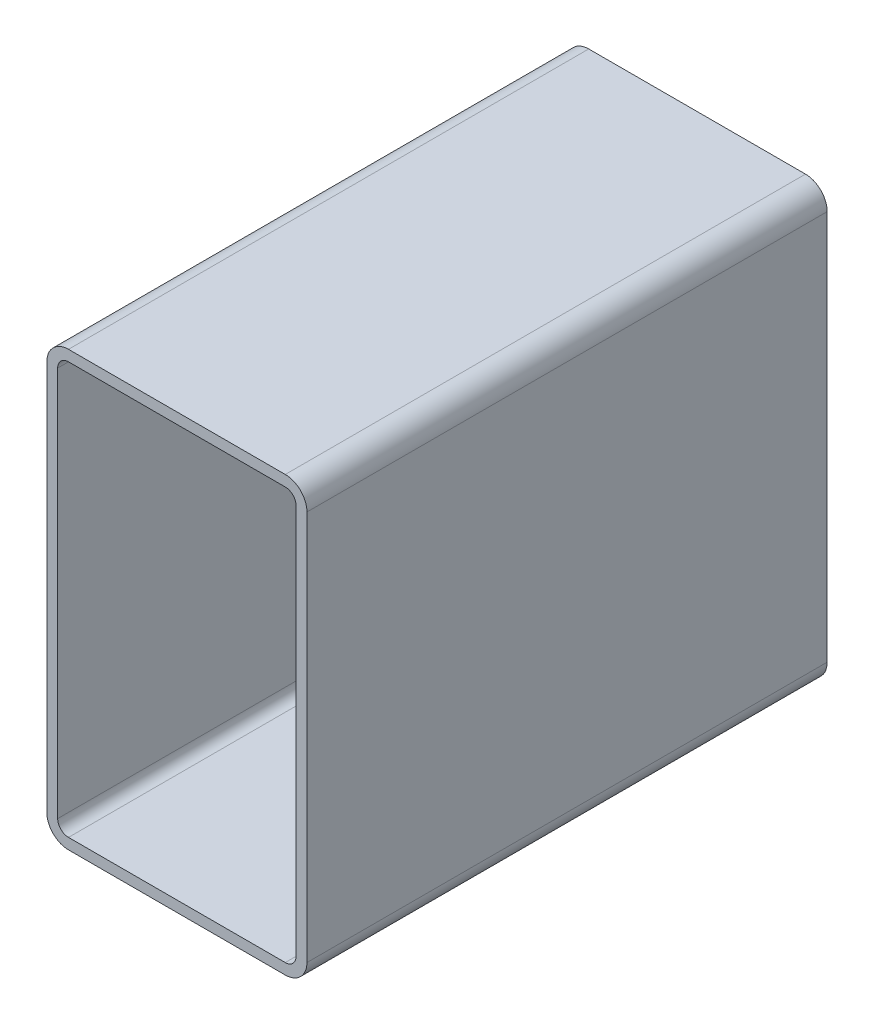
ISO-10303-21;
HEADER;
FILE_DESCRIPTION(('STEP AP214'),'2;1');
FILE_NAME('part.step','',(''),(''),'','','');
FILE_SCHEMA(('AUTOMOTIVE_DESIGN { 1 0 10303 214 1 1 1 1 }'));
ENDSEC;
DATA;
#1=APPLICATION_CONTEXT('core data for automotive mechanical design processes');
#2=APPLICATION_PROTOCOL_DEFINITION('international standard','automotive_design',2000,#1);
#3=PRODUCT_CONTEXT('',#1,'mechanical');
#4=PRODUCT('Part','Part','',(#3));
#5=PRODUCT_RELATED_PRODUCT_CATEGORY('part','',(#4));
#6=PRODUCT_DEFINITION_FORMATION('','',#4);
#7=PRODUCT_DEFINITION_CONTEXT('part definition',#1,'design');
#8=PRODUCT_DEFINITION('design','',#6,#7);
#9=PRODUCT_DEFINITION_SHAPE('','',#8);
#10=(LENGTH_UNIT() NAMED_UNIT(*) SI_UNIT(.MILLI.,.METRE.));
#11=(NAMED_UNIT(*) PLANE_ANGLE_UNIT() SI_UNIT($,.RADIAN.));
#12=(NAMED_UNIT(*) SI_UNIT($,.STERADIAN.) SOLID_ANGLE_UNIT());
#13=UNCERTAINTY_MEASURE_WITH_UNIT(LENGTH_MEASURE(1.E-05),#10,'distance_accuracy_value','');
#14=(GEOMETRIC_REPRESENTATION_CONTEXT(3) GLOBAL_UNCERTAINTY_ASSIGNED_CONTEXT((#13)) GLOBAL_UNIT_ASSIGNED_CONTEXT((#10,
#11,#12)) REPRESENTATION_CONTEXT('',''));
#15=CARTESIAN_POINT('',(0.,0.,0.));
#16=DIRECTION('',(0.,0.,1.));
#17=DIRECTION('',(1.,0.,0.));
#18=AXIS2_PLACEMENT_3D('',#15,#16,#17);
#19=CARTESIAN_POINT('',(12.7473013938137,243.220313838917,304.8));
#20=DIRECTION('',(0.,0.,1.));
#21=DIRECTION('',(1.,0.,0.));
#22=AXIS2_PLACEMENT_3D('',#19,#20,#21);
#23=PLANE('',#22);
#24=CARTESIAN_POINT('',(12.7473013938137,243.220313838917,304.8));
#25=DIRECTION('',(0.,0.,1.));
#26=DIRECTION('',(1.,0.,0.));
#27=AXIS2_PLACEMENT_3D('',#24,#25,#26);
#28=CIRCLE('',#27,12.7);
#29=CARTESIAN_POINT('',(12.7473013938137,255.920313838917,304.8));
#30=VERTEX_POINT('',#29);
#31=CARTESIAN_POINT('',(0.0473013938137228,243.220313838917,304.8));
#32=VERTEX_POINT('',#31);
#33=EDGE_CURVE('E211',#30,#32,#28,.T.);
#34=ORIENTED_EDGE('',*,*,#33,.T.);
#35=DIRECTION('',(0.,-1.,0.));
#36=VECTOR('',#35,1.);
#37=CARTESIAN_POINT('',(0.0473013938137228,14.6203138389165,304.8));
#38=LINE('',#37,#36);
#39=CARTESIAN_POINT('',(0.0473013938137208,14.6203138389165,304.8));
#40=VERTEX_POINT('',#39);
#41=EDGE_CURVE('E214',#32,#40,#38,.T.);
#42=ORIENTED_EDGE('',*,*,#41,.T.);
#43=CARTESIAN_POINT('',(12.7473013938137,14.6203138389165,304.8));
#44=DIRECTION('',(0.,0.,1.));
#45=DIRECTION('',(1.,0.,0.));
#46=AXIS2_PLACEMENT_3D('',#43,#44,#45);
#47=CIRCLE('',#46,12.7);
#48=CARTESIAN_POINT('',(12.7473013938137,1.92031383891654,304.8));
#49=VERTEX_POINT('',#48);
#50=EDGE_CURVE('E217',#40,#49,#47,.T.);
#51=ORIENTED_EDGE('',*,*,#50,.T.);
#52=DIRECTION('',(1.,0.,0.));
#53=VECTOR('',#52,1.);
#54=CARTESIAN_POINT('',(139.747301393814,1.92031383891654,304.8));
#55=LINE('',#54,#53);
#56=CARTESIAN_POINT('',(139.747301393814,1.92031383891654,304.8));
#57=VERTEX_POINT('',#56);
#58=EDGE_CURVE('E219',#49,#57,#55,.T.);
#59=ORIENTED_EDGE('',*,*,#58,.T.);
#60=CARTESIAN_POINT('',(139.747301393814,14.6203138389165,304.8));
#61=DIRECTION('',(0.,0.,1.));
#62=DIRECTION('',(1.,0.,0.));
#63=AXIS2_PLACEMENT_3D('',#60,#61,#62);
#64=CIRCLE('',#63,12.7);
#65=CARTESIAN_POINT('',(152.447301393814,14.6203138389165,304.8));
#66=VERTEX_POINT('',#65);
#67=EDGE_CURVE('E221',#57,#66,#64,.T.);
#68=ORIENTED_EDGE('',*,*,#67,.T.);
#69=DIRECTION('',(0.,1.,0.));
#70=VECTOR('',#69,1.);
#71=CARTESIAN_POINT('',(152.447301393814,243.220313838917,304.8));
#72=LINE('',#71,#70);
#73=CARTESIAN_POINT('',(152.447301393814,243.220313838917,304.8));
#74=VERTEX_POINT('',#73);
#75=EDGE_CURVE('E223',#66,#74,#72,.T.);
#76=ORIENTED_EDGE('',*,*,#75,.T.);
#77=CARTESIAN_POINT('',(139.747301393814,243.220313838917,304.8));
#78=DIRECTION('',(0.,0.,1.));
#79=DIRECTION('',(1.,0.,0.));
#80=AXIS2_PLACEMENT_3D('',#77,#78,#79);
#81=CIRCLE('',#80,12.7);
#82=CARTESIAN_POINT('',(139.747301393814,255.920313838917,304.8));
#83=VERTEX_POINT('',#82);
#84=EDGE_CURVE('E225',#74,#83,#81,.T.);
#85=ORIENTED_EDGE('',*,*,#84,.T.);
#86=DIRECTION('',(-1.,0.,0.));
#87=VECTOR('',#86,1.);
#88=CARTESIAN_POINT('',(12.7473013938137,255.920313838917,304.8));
#89=LINE('',#88,#87);
#90=EDGE_CURVE('E227',#83,#30,#89,.T.);
#91=ORIENTED_EDGE('',*,*,#90,.T.);
#92=EDGE_LOOP('',(#34,#42,#51,#59,#68,#76,#85,#91));
#93=FACE_BOUND('',#92,.T.);
#94=DIRECTION('',(0.,-1.,0.));
#95=VECTOR('',#94,1.);
#96=CARTESIAN_POINT('',(6.39730139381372,14.6203138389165,304.8));
#97=LINE('',#96,#95);
#98=CARTESIAN_POINT('',(6.39730139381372,243.220313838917,304.8));
#99=VERTEX_POINT('',#98);
#100=CARTESIAN_POINT('',(6.39730139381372,14.6203138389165,304.8));
#101=VERTEX_POINT('',#100);
#102=EDGE_CURVE('E154',#99,#101,#97,.T.);
#103=ORIENTED_EDGE('',*,*,#102,.F.);
#104=CARTESIAN_POINT('',(12.7473013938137,243.220313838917,304.8));
#105=DIRECTION('',(0.,0.,1.));
#106=DIRECTION('',(1.,0.,0.));
#107=AXIS2_PLACEMENT_3D('',#104,#105,#106);
#108=CIRCLE('',#107,6.35000000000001);
#109=CARTESIAN_POINT('',(12.7473013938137,249.570313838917,304.8));
#110=VERTEX_POINT('',#109);
#111=EDGE_CURVE('E146',#110,#99,#108,.T.);
#112=ORIENTED_EDGE('',*,*,#111,.F.);
#113=DIRECTION('',(-1.,0.,0.));
#114=VECTOR('',#113,1.);
#115=CARTESIAN_POINT('',(12.7473013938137,249.570313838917,304.8));
#116=LINE('',#115,#114);
#117=CARTESIAN_POINT('',(139.747301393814,249.570313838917,304.8));
#118=VERTEX_POINT('',#117);
#119=EDGE_CURVE('E179',#118,#110,#116,.T.);
#120=ORIENTED_EDGE('',*,*,#119,.F.);
#121=CARTESIAN_POINT('',(139.747301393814,243.220313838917,304.8));
#122=DIRECTION('',(0.,0.,1.));
#123=DIRECTION('',(1.,0.,0.));
#124=AXIS2_PLACEMENT_3D('',#121,#122,#123);
#125=CIRCLE('',#124,6.35000000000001);
#126=CARTESIAN_POINT('',(146.097301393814,243.220313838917,304.8));
#127=VERTEX_POINT('',#126);
#128=EDGE_CURVE('E177',#127,#118,#125,.T.);
#129=ORIENTED_EDGE('',*,*,#128,.F.);
#130=DIRECTION('',(0.,1.,0.));
#131=VECTOR('',#130,1.);
#132=CARTESIAN_POINT('',(146.097301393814,243.220313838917,304.8));
#133=LINE('',#132,#131);
#134=CARTESIAN_POINT('',(146.097301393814,14.6203138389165,304.8));
#135=VERTEX_POINT('',#134);
#136=EDGE_CURVE('E175',#135,#127,#133,.T.);
#137=ORIENTED_EDGE('',*,*,#136,.F.);
#138=CARTESIAN_POINT('',(139.747301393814,14.6203138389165,304.8));
#139=DIRECTION('',(0.,0.,1.));
#140=DIRECTION('',(1.,0.,0.));
#141=AXIS2_PLACEMENT_3D('',#138,#139,#140);
#142=CIRCLE('',#141,6.35);
#143=CARTESIAN_POINT('',(139.747301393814,8.27031383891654,304.8));
#144=VERTEX_POINT('',#143);
#145=EDGE_CURVE('E173',#144,#135,#142,.T.);
#146=ORIENTED_EDGE('',*,*,#145,.F.);
#147=DIRECTION('',(1.,0.,0.));
#148=VECTOR('',#147,1.);
#149=CARTESIAN_POINT('',(139.747301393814,8.27031383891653,304.8));
#150=LINE('',#149,#148);
#151=CARTESIAN_POINT('',(12.7473013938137,8.27031383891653,304.8));
#152=VERTEX_POINT('',#151);
#153=EDGE_CURVE('E169',#152,#144,#150,.T.);
#154=ORIENTED_EDGE('',*,*,#153,.F.);
#155=CARTESIAN_POINT('',(12.7473013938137,14.6203138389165,304.8));
#156=DIRECTION('',(0.,0.,1.));
#157=DIRECTION('',(1.,0.,0.));
#158=AXIS2_PLACEMENT_3D('',#155,#156,#157);
#159=CIRCLE('',#158,6.35);
#160=EDGE_CURVE('E167',#101,#152,#159,.T.);
#161=ORIENTED_EDGE('',*,*,#160,.F.);
#162=EDGE_LOOP('',(#103,#112,#120,#129,#137,#146,#154,#161));
#163=FACE_BOUND('',#162,.T.);
#164=ADVANCED_FACE('F33',(#93,#163),#23,.T.);
#165=CARTESIAN_POINT('',(12.7473013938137,243.220313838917,0.));
#166=DIRECTION('',(0.,0.,1.));
#167=DIRECTION('',(1.,0.,0.));
#168=AXIS2_PLACEMENT_3D('',#165,#166,#167);
#169=PLANE('',#168);
#170=CARTESIAN_POINT('',(12.7473013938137,243.220313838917,0.));
#171=DIRECTION('',(0.,0.,1.));
#172=DIRECTION('',(1.,0.,0.));
#173=AXIS2_PLACEMENT_3D('',#170,#171,#172);
#174=CIRCLE('',#173,12.7);
#175=CARTESIAN_POINT('',(12.7473013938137,255.920313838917,0.));
#176=VERTEX_POINT('',#175);
#177=CARTESIAN_POINT('',(0.0473013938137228,243.220313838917,0.));
#178=VERTEX_POINT('',#177);
#179=EDGE_CURVE('E162',#176,#178,#174,.T.);
#180=ORIENTED_EDGE('',*,*,#179,.F.);
#181=DIRECTION('',(-1.,0.,0.));
#182=VECTOR('',#181,1.);
#183=CARTESIAN_POINT('',(12.7473013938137,255.920313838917,0.));
#184=LINE('',#183,#182);
#185=CARTESIAN_POINT('',(139.747301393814,255.920313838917,0.));
#186=VERTEX_POINT('',#185);
#187=EDGE_CURVE('E215',#186,#176,#184,.T.);
#188=ORIENTED_EDGE('',*,*,#187,.F.);
#189=CARTESIAN_POINT('',(139.747301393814,243.220313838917,0.));
#190=DIRECTION('',(0.,0.,1.));
#191=DIRECTION('',(1.,0.,0.));
#192=AXIS2_PLACEMENT_3D('',#189,#190,#191);
#193=CIRCLE('',#192,12.7);
#194=CARTESIAN_POINT('',(152.447301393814,243.220313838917,0.));
#195=VERTEX_POINT('',#194);
#196=EDGE_CURVE('E242',#195,#186,#193,.T.);
#197=ORIENTED_EDGE('',*,*,#196,.F.);
#198=DIRECTION('',(0.,1.,0.));
#199=VECTOR('',#198,1.);
#200=CARTESIAN_POINT('',(152.447301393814,243.220313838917,0.));
#201=LINE('',#200,#199);
#202=CARTESIAN_POINT('',(152.447301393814,14.6203138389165,0.));
#203=VERTEX_POINT('',#202);
#204=EDGE_CURVE('E240',#203,#195,#201,.T.);
#205=ORIENTED_EDGE('',*,*,#204,.F.);
#206=CARTESIAN_POINT('',(139.747301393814,14.6203138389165,0.));
#207=DIRECTION('',(0.,0.,1.));
#208=DIRECTION('',(1.,0.,0.));
#209=AXIS2_PLACEMENT_3D('',#206,#207,#208);
#210=CIRCLE('',#209,12.7);
#211=CARTESIAN_POINT('',(139.747301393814,1.92031383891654,0.));
#212=VERTEX_POINT('',#211);
#213=EDGE_CURVE('E238',#212,#203,#210,.T.);
#214=ORIENTED_EDGE('',*,*,#213,.F.);
#215=DIRECTION('',(1.,0.,0.));
#216=VECTOR('',#215,1.);
#217=CARTESIAN_POINT('',(139.747301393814,1.92031383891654,0.));
#218=LINE('',#217,#216);
#219=CARTESIAN_POINT('',(12.7473013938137,1.92031383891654,0.));
#220=VERTEX_POINT('',#219);
#221=EDGE_CURVE('E236',#220,#212,#218,.T.);
#222=ORIENTED_EDGE('',*,*,#221,.F.);
#223=CARTESIAN_POINT('',(12.7473013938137,14.6203138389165,0.));
#224=DIRECTION('',(0.,0.,1.));
#225=DIRECTION('',(1.,0.,0.));
#226=AXIS2_PLACEMENT_3D('',#223,#224,#225);
#227=CIRCLE('',#226,12.7);
#228=CARTESIAN_POINT('',(0.0473013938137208,14.6203138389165,0.));
#229=VERTEX_POINT('',#228);
#230=EDGE_CURVE('E234',#229,#220,#227,.T.);
#231=ORIENTED_EDGE('',*,*,#230,.F.);
#232=DIRECTION('',(0.,-1.,0.));
#233=VECTOR('',#232,1.);
#234=CARTESIAN_POINT('',(0.0473013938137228,14.6203138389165,0.));
#235=LINE('',#234,#233);
#236=EDGE_CURVE('E232',#178,#229,#235,.T.);
#237=ORIENTED_EDGE('',*,*,#236,.F.);
#238=EDGE_LOOP('',(#180,#188,#197,#205,#214,#222,#231,#237));
#239=FACE_BOUND('',#238,.T.);
#240=CARTESIAN_POINT('',(12.7473013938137,243.220313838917,0.));
#241=DIRECTION('',(0.,0.,1.));
#242=DIRECTION('',(1.,0.,0.));
#243=AXIS2_PLACEMENT_3D('',#240,#241,#242);
#244=CIRCLE('',#243,6.35000000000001);
#245=CARTESIAN_POINT('',(12.7473013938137,249.570313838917,0.));
#246=VERTEX_POINT('',#245);
#247=CARTESIAN_POINT('',(6.39730139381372,243.220313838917,0.));
#248=VERTEX_POINT('',#247);
#249=EDGE_CURVE('E56',#246,#248,#244,.T.);
#250=ORIENTED_EDGE('',*,*,#249,.T.);
#251=DIRECTION('',(0.,-1.,0.));
#252=VECTOR('',#251,1.);
#253=CARTESIAN_POINT('',(6.39730139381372,14.6203138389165,0.));
#254=LINE('',#253,#252);
#255=CARTESIAN_POINT('',(6.39730139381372,14.6203138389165,0.));
#256=VERTEX_POINT('',#255);
#257=EDGE_CURVE('E161',#248,#256,#254,.T.);
#258=ORIENTED_EDGE('',*,*,#257,.T.);
#259=CARTESIAN_POINT('',(12.7473013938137,14.6203138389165,0.));
#260=DIRECTION('',(0.,0.,1.));
#261=DIRECTION('',(1.,0.,0.));
#262=AXIS2_PLACEMENT_3D('',#259,#260,#261);
#263=CIRCLE('',#262,6.35);
#264=CARTESIAN_POINT('',(12.7473013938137,8.27031383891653,0.));
#265=VERTEX_POINT('',#264);
#266=EDGE_CURVE('E183',#256,#265,#263,.T.);
#267=ORIENTED_EDGE('',*,*,#266,.T.);
#268=DIRECTION('',(1.,0.,0.));
#269=VECTOR('',#268,1.);
#270=CARTESIAN_POINT('',(139.747301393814,8.27031383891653,0.));
#271=LINE('',#270,#269);
#272=CARTESIAN_POINT('',(139.747301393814,8.27031383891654,0.));
#273=VERTEX_POINT('',#272);
#274=EDGE_CURVE('E186',#265,#273,#271,.T.);
#275=ORIENTED_EDGE('',*,*,#274,.T.);
#276=CARTESIAN_POINT('',(139.747301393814,14.6203138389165,0.));
#277=DIRECTION('',(0.,0.,1.));
#278=DIRECTION('',(1.,0.,0.));
#279=AXIS2_PLACEMENT_3D('',#276,#277,#278);
#280=CIRCLE('',#279,6.35);
#281=CARTESIAN_POINT('',(146.097301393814,14.6203138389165,0.));
#282=VERTEX_POINT('',#281);
#283=EDGE_CURVE('E189',#273,#282,#280,.T.);
#284=ORIENTED_EDGE('',*,*,#283,.T.);
#285=DIRECTION('',(0.,1.,0.));
#286=VECTOR('',#285,1.);
#287=CARTESIAN_POINT('',(146.097301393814,243.220313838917,0.));
#288=LINE('',#287,#286);
#289=CARTESIAN_POINT('',(146.097301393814,243.220313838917,0.));
#290=VERTEX_POINT('',#289);
#291=EDGE_CURVE('E192',#282,#290,#288,.T.);
#292=ORIENTED_EDGE('',*,*,#291,.T.);
#293=CARTESIAN_POINT('',(139.747301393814,243.220313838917,0.));
#294=DIRECTION('',(0.,0.,1.));
#295=DIRECTION('',(1.,0.,0.));
#296=AXIS2_PLACEMENT_3D('',#293,#294,#295);
#297=CIRCLE('',#296,6.35000000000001);
#298=CARTESIAN_POINT('',(139.747301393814,249.570313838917,0.));
#299=VERTEX_POINT('',#298);
#300=EDGE_CURVE('E195',#290,#299,#297,.T.);
#301=ORIENTED_EDGE('',*,*,#300,.T.);
#302=DIRECTION('',(-1.,0.,0.));
#303=VECTOR('',#302,1.);
#304=CARTESIAN_POINT('',(12.7473013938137,249.570313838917,0.));
#305=LINE('',#304,#303);
#306=EDGE_CURVE('E155',#299,#246,#305,.T.);
#307=ORIENTED_EDGE('',*,*,#306,.T.);
#308=EDGE_LOOP('',(#250,#258,#267,#275,#284,#292,#301,#307));
#309=FACE_BOUND('',#308,.T.);
#310=ADVANCED_FACE('F272',(#239,#309),#169,.F.);
#311=CARTESIAN_POINT('',(12.7473013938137,243.220313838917,304.8));
#312=DIRECTION('',(0.,0.,-1.));
#313=DIRECTION('',(-1.,0.,0.));
#314=AXIS2_PLACEMENT_3D('',#311,#312,#313);
#315=CYLINDRICAL_SURFACE('',#314,12.7);
#316=ORIENTED_EDGE('',*,*,#179,.T.);
#317=DIRECTION('',(0.,0.,-1.));
#318=VECTOR('',#317,1.);
#319=CARTESIAN_POINT('',(0.0473013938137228,243.220313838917,304.8));
#320=LINE('',#319,#318);
#321=EDGE_CURVE('E11',#32,#178,#320,.T.);
#322=ORIENTED_EDGE('',*,*,#321,.F.);
#323=ORIENTED_EDGE('',*,*,#33,.F.);
#324=DIRECTION('',(0.,0.,-1.));
#325=VECTOR('',#324,1.);
#326=CARTESIAN_POINT('',(12.7473013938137,255.920313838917,304.8));
#327=LINE('',#326,#325);
#328=EDGE_CURVE('E229',#30,#176,#327,.T.);
#329=ORIENTED_EDGE('',*,*,#328,.T.);
#330=EDGE_LOOP('',(#316,#322,#323,#329));
#331=FACE_BOUND('',#330,.T.);
#332=ADVANCED_FACE('F35',(#331),#315,.T.);
#333=CARTESIAN_POINT('',(0.0473013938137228,14.6203138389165,304.8));
#334=DIRECTION('',(1.,0.,0.));
#335=DIRECTION('',(0.,0.,-1.));
#336=AXIS2_PLACEMENT_3D('',#333,#334,#335);
#337=PLANE('',#336);
#338=ORIENTED_EDGE('',*,*,#236,.T.);
#339=DIRECTION('',(0.,0.,-1.));
#340=VECTOR('',#339,1.);
#341=CARTESIAN_POINT('',(0.0473013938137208,14.6203138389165,304.8));
#342=LINE('',#341,#340);
#343=EDGE_CURVE('E41',#40,#229,#342,.T.);
#344=ORIENTED_EDGE('',*,*,#343,.F.);
#345=ORIENTED_EDGE('',*,*,#41,.F.);
#346=ORIENTED_EDGE('',*,*,#321,.T.);
#347=EDGE_LOOP('',(#338,#344,#345,#346));
#348=FACE_BOUND('',#347,.T.);
#349=ADVANCED_FACE('F289',(#348),#337,.F.);
#350=CARTESIAN_POINT('',(12.7473013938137,14.6203138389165,304.8));
#351=DIRECTION('',(0.,0.,-1.));
#352=DIRECTION('',(-1.,0.,0.));
#353=AXIS2_PLACEMENT_3D('',#350,#351,#352);
#354=CYLINDRICAL_SURFACE('',#353,12.7);
#355=ORIENTED_EDGE('',*,*,#230,.T.);
#356=DIRECTION('',(0.,0.,-1.));
#357=VECTOR('',#356,1.);
#358=CARTESIAN_POINT('',(12.7473013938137,1.92031383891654,304.8));
#359=LINE('',#358,#357);
#360=EDGE_CURVE('E259',#49,#220,#359,.T.);
#361=ORIENTED_EDGE('',*,*,#360,.F.);
#362=ORIENTED_EDGE('',*,*,#50,.F.);
#363=ORIENTED_EDGE('',*,*,#343,.T.);
#364=EDGE_LOOP('',(#355,#361,#362,#363));
#365=FACE_BOUND('',#364,.T.);
#366=ADVANCED_FACE('F266',(#365),#354,.T.);
#367=CARTESIAN_POINT('',(139.747301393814,1.92031383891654,304.8));
#368=DIRECTION('',(0.,1.,0.));
#369=DIRECTION('',(0.,0.,1.));
#370=AXIS2_PLACEMENT_3D('',#367,#368,#369);
#371=PLANE('',#370);
#372=ORIENTED_EDGE('',*,*,#221,.T.);
#373=DIRECTION('',(0.,0.,-1.));
#374=VECTOR('',#373,1.);
#375=CARTESIAN_POINT('',(139.747301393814,1.92031383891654,304.8));
#376=LINE('',#375,#374);
#377=EDGE_CURVE('E256',#57,#212,#376,.T.);
#378=ORIENTED_EDGE('',*,*,#377,.F.);
#379=ORIENTED_EDGE('',*,*,#58,.F.);
#380=ORIENTED_EDGE('',*,*,#360,.T.);
#381=EDGE_LOOP('',(#372,#378,#379,#380));
#382=FACE_BOUND('',#381,.T.);
#383=ADVANCED_FACE('F278',(#382),#371,.F.);
#384=CARTESIAN_POINT('',(139.747301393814,14.6203138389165,304.8));
#385=DIRECTION('',(0.,0.,-1.));
#386=DIRECTION('',(-1.,0.,0.));
#387=AXIS2_PLACEMENT_3D('',#384,#385,#386);
#388=CYLINDRICAL_SURFACE('',#387,12.7);
#389=ORIENTED_EDGE('',*,*,#213,.T.);
#390=DIRECTION('',(0.,0.,-1.));
#391=VECTOR('',#390,1.);
#392=CARTESIAN_POINT('',(152.447301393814,14.6203138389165,304.8));
#393=LINE('',#392,#391);
#394=EDGE_CURVE('E253',#66,#203,#393,.T.);
#395=ORIENTED_EDGE('',*,*,#394,.F.);
#396=ORIENTED_EDGE('',*,*,#67,.F.);
#397=ORIENTED_EDGE('',*,*,#377,.T.);
#398=EDGE_LOOP('',(#389,#395,#396,#397));
#399=FACE_BOUND('',#398,.T.);
#400=ADVANCED_FACE('F282',(#399),#388,.T.);
#401=CARTESIAN_POINT('',(152.447301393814,243.220313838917,304.8));
#402=DIRECTION('',(-1.,0.,0.));
#403=DIRECTION('',(0.,0.,1.));
#404=AXIS2_PLACEMENT_3D('',#401,#402,#403);
#405=PLANE('',#404);
#406=ORIENTED_EDGE('',*,*,#204,.T.);
#407=DIRECTION('',(0.,0.,-1.));
#408=VECTOR('',#407,1.);
#409=CARTESIAN_POINT('',(152.447301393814,243.220313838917,304.8));
#410=LINE('',#409,#408);
#411=EDGE_CURVE('E250',#74,#195,#410,.T.);
#412=ORIENTED_EDGE('',*,*,#411,.F.);
#413=ORIENTED_EDGE('',*,*,#75,.F.);
#414=ORIENTED_EDGE('',*,*,#394,.T.);
#415=EDGE_LOOP('',(#406,#412,#413,#414));
#416=FACE_BOUND('',#415,.T.);
#417=ADVANCED_FACE('F302',(#416),#405,.F.);
#418=CARTESIAN_POINT('',(139.747301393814,243.220313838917,304.8));
#419=DIRECTION('',(0.,0.,-1.));
#420=DIRECTION('',(-1.,0.,0.));
#421=AXIS2_PLACEMENT_3D('',#418,#419,#420);
#422=CYLINDRICAL_SURFACE('',#421,12.7);
#423=ORIENTED_EDGE('',*,*,#196,.T.);
#424=DIRECTION('',(0.,0.,-1.));
#425=VECTOR('',#424,1.);
#426=CARTESIAN_POINT('',(139.747301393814,255.920313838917,304.8));
#427=LINE('',#426,#425);
#428=EDGE_CURVE('E247',#83,#186,#427,.T.);
#429=ORIENTED_EDGE('',*,*,#428,.F.);
#430=ORIENTED_EDGE('',*,*,#84,.F.);
#431=ORIENTED_EDGE('',*,*,#411,.T.);
#432=EDGE_LOOP('',(#423,#429,#430,#431));
#433=FACE_BOUND('',#432,.T.);
#434=ADVANCED_FACE('F300',(#433),#422,.T.);
#435=CARTESIAN_POINT('',(12.7473013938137,255.920313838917,304.8));
#436=DIRECTION('',(0.,-1.,0.));
#437=DIRECTION('',(0.,0.,-1.));
#438=AXIS2_PLACEMENT_3D('',#435,#436,#437);
#439=PLANE('',#438);
#440=ORIENTED_EDGE('',*,*,#187,.T.);
#441=ORIENTED_EDGE('',*,*,#328,.F.);
#442=ORIENTED_EDGE('',*,*,#90,.F.);
#443=ORIENTED_EDGE('',*,*,#428,.T.);
#444=EDGE_LOOP('',(#440,#441,#442,#443));
#445=FACE_BOUND('',#444,.T.);
#446=ADVANCED_FACE('F295',(#445),#439,.F.);
#447=CARTESIAN_POINT('',(12.7473013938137,243.220313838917,304.8));
#448=DIRECTION('',(0.,0.,-1.));
#449=DIRECTION('',(-1.,0.,0.));
#450=AXIS2_PLACEMENT_3D('',#447,#448,#449);
#451=CYLINDRICAL_SURFACE('',#450,6.35000000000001);
#452=ORIENTED_EDGE('',*,*,#249,.F.);
#453=DIRECTION('',(0.,0.,-1.));
#454=VECTOR('',#453,1.);
#455=CARTESIAN_POINT('',(12.7473013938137,249.570313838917,304.8));
#456=LINE('',#455,#454);
#457=EDGE_CURVE('E150',#110,#246,#456,.T.);
#458=ORIENTED_EDGE('',*,*,#457,.F.);
#459=ORIENTED_EDGE('',*,*,#111,.T.);
#460=DIRECTION('',(0.,0.,-1.));
#461=VECTOR('',#460,1.);
#462=CARTESIAN_POINT('',(6.39730139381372,243.220313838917,304.8));
#463=LINE('',#462,#461);
#464=EDGE_CURVE('E149',#99,#248,#463,.T.);
#465=ORIENTED_EDGE('',*,*,#464,.T.);
#466=EDGE_LOOP('',(#452,#458,#459,#465));
#467=FACE_BOUND('',#466,.T.);
#468=ADVANCED_FACE('F148',(#467),#451,.F.);
#469=CARTESIAN_POINT('',(6.39730139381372,14.6203138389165,304.8));
#470=DIRECTION('',(1.,0.,0.));
#471=DIRECTION('',(0.,0.,-1.));
#472=AXIS2_PLACEMENT_3D('',#469,#470,#471);
#473=PLANE('',#472);
#474=ORIENTED_EDGE('',*,*,#257,.F.);
#475=ORIENTED_EDGE('',*,*,#464,.F.);
#476=ORIENTED_EDGE('',*,*,#102,.T.);
#477=DIRECTION('',(0.,0.,-1.));
#478=VECTOR('',#477,1.);
#479=CARTESIAN_POINT('',(6.39730139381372,14.6203138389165,304.8));
#480=LINE('',#479,#478);
#481=EDGE_CURVE('E163',#101,#256,#480,.T.);
#482=ORIENTED_EDGE('',*,*,#481,.T.);
#483=EDGE_LOOP('',(#474,#475,#476,#482));
#484=FACE_BOUND('',#483,.T.);
#485=ADVANCED_FACE('F158',(#484),#473,.T.);
#486=CARTESIAN_POINT('',(12.7473013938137,14.6203138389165,304.8));
#487=DIRECTION('',(0.,0.,-1.));
#488=DIRECTION('',(-1.,0.,0.));
#489=AXIS2_PLACEMENT_3D('',#486,#487,#488);
#490=CYLINDRICAL_SURFACE('',#489,6.35);
#491=ORIENTED_EDGE('',*,*,#266,.F.);
#492=ORIENTED_EDGE('',*,*,#481,.F.);
#493=ORIENTED_EDGE('',*,*,#160,.T.);
#494=DIRECTION('',(0.,0.,-1.));
#495=VECTOR('',#494,1.);
#496=CARTESIAN_POINT('',(12.7473013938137,8.27031383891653,304.8));
#497=LINE('',#496,#495);
#498=EDGE_CURVE('E208',#152,#265,#497,.T.);
#499=ORIENTED_EDGE('',*,*,#498,.T.);
#500=EDGE_LOOP('',(#491,#492,#493,#499));
#501=FACE_BOUND('',#500,.T.);
#502=ADVANCED_FACE('F327',(#501),#490,.F.);
#503=CARTESIAN_POINT('',(139.747301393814,8.27031383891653,304.8));
#504=DIRECTION('',(0.,1.,0.));
#505=DIRECTION('',(0.,0.,1.));
#506=AXIS2_PLACEMENT_3D('',#503,#504,#505);
#507=PLANE('',#506);
#508=ORIENTED_EDGE('',*,*,#274,.F.);
#509=ORIENTED_EDGE('',*,*,#498,.F.);
#510=ORIENTED_EDGE('',*,*,#153,.T.);
#511=DIRECTION('',(0.,0.,-1.));
#512=VECTOR('',#511,1.);
#513=CARTESIAN_POINT('',(139.747301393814,8.27031383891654,304.8));
#514=LINE('',#513,#512);
#515=EDGE_CURVE('E206',#144,#273,#514,.T.);
#516=ORIENTED_EDGE('',*,*,#515,.T.);
#517=EDGE_LOOP('',(#508,#509,#510,#516));
#518=FACE_BOUND('',#517,.T.);
#519=ADVANCED_FACE('F331',(#518),#507,.T.);
#520=CARTESIAN_POINT('',(139.747301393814,14.6203138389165,304.8));
#521=DIRECTION('',(0.,0.,-1.));
#522=DIRECTION('',(-1.,0.,0.));
#523=AXIS2_PLACEMENT_3D('',#520,#521,#522);
#524=CYLINDRICAL_SURFACE('',#523,6.35);
#525=ORIENTED_EDGE('',*,*,#283,.F.);
#526=ORIENTED_EDGE('',*,*,#515,.F.);
#527=ORIENTED_EDGE('',*,*,#145,.T.);
#528=DIRECTION('',(0.,0.,-1.));
#529=VECTOR('',#528,1.);
#530=CARTESIAN_POINT('',(146.097301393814,14.6203138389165,304.8));
#531=LINE('',#530,#529);
#532=EDGE_CURVE('E204',#135,#282,#531,.T.);
#533=ORIENTED_EDGE('',*,*,#532,.T.);
#534=EDGE_LOOP('',(#525,#526,#527,#533));
#535=FACE_BOUND('',#534,.T.);
#536=ADVANCED_FACE('F337',(#535),#524,.F.);
#537=CARTESIAN_POINT('',(146.097301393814,243.220313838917,304.8));
#538=DIRECTION('',(-1.,0.,0.));
#539=DIRECTION('',(0.,0.,1.));
#540=AXIS2_PLACEMENT_3D('',#537,#538,#539);
#541=PLANE('',#540);
#542=ORIENTED_EDGE('',*,*,#291,.F.);
#543=ORIENTED_EDGE('',*,*,#532,.F.);
#544=ORIENTED_EDGE('',*,*,#136,.T.);
#545=DIRECTION('',(0.,0.,-1.));
#546=VECTOR('',#545,1.);
#547=CARTESIAN_POINT('',(146.097301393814,243.220313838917,304.8));
#548=LINE('',#547,#546);
#549=EDGE_CURVE('E202',#127,#290,#548,.T.);
#550=ORIENTED_EDGE('',*,*,#549,.T.);
#551=EDGE_LOOP('',(#542,#543,#544,#550));
#552=FACE_BOUND('',#551,.T.);
#553=ADVANCED_FACE('F341',(#552),#541,.T.);
#554=CARTESIAN_POINT('',(139.747301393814,243.220313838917,304.8));
#555=DIRECTION('',(0.,0.,-1.));
#556=DIRECTION('',(-1.,0.,0.));
#557=AXIS2_PLACEMENT_3D('',#554,#555,#556);
#558=CYLINDRICAL_SURFACE('',#557,6.35000000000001);
#559=ORIENTED_EDGE('',*,*,#300,.F.);
#560=ORIENTED_EDGE('',*,*,#549,.F.);
#561=ORIENTED_EDGE('',*,*,#128,.T.);
#562=DIRECTION('',(0.,0.,-1.));
#563=VECTOR('',#562,1.);
#564=CARTESIAN_POINT('',(139.747301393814,249.570313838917,304.8));
#565=LINE('',#564,#563);
#566=EDGE_CURVE('E48',#118,#299,#565,.T.);
#567=ORIENTED_EDGE('',*,*,#566,.T.);
#568=EDGE_LOOP('',(#559,#560,#561,#567));
#569=FACE_BOUND('',#568,.T.);
#570=ADVANCED_FACE('F345',(#569),#558,.F.);
#571=CARTESIAN_POINT('',(12.7473013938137,249.570313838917,304.8));
#572=DIRECTION('',(0.,-1.,0.));
#573=DIRECTION('',(0.,0.,-1.));
#574=AXIS2_PLACEMENT_3D('',#571,#572,#573);
#575=PLANE('',#574);
#576=ORIENTED_EDGE('',*,*,#306,.F.);
#577=ORIENTED_EDGE('',*,*,#566,.F.);
#578=ORIENTED_EDGE('',*,*,#119,.T.);
#579=ORIENTED_EDGE('',*,*,#457,.T.);
#580=EDGE_LOOP('',(#576,#577,#578,#579));
#581=FACE_BOUND('',#580,.T.);
#582=ADVANCED_FACE('F349',(#581),#575,.T.);
#583=CLOSED_SHELL('',(#164,#310,#332,#349,#366,#383,#400,#417,#434,#446,#468,#485,#502,#519,
#536,#553,#570,#582));
#584=MANIFOLD_SOLID_BREP('B2',#583);
#585=ADVANCED_BREP_SHAPE_REPRESENTATION('',(#18,#584),#14);
#586=SHAPE_DEFINITION_REPRESENTATION(#9,#585);
ENDSEC;
END-ISO-10303-21;
